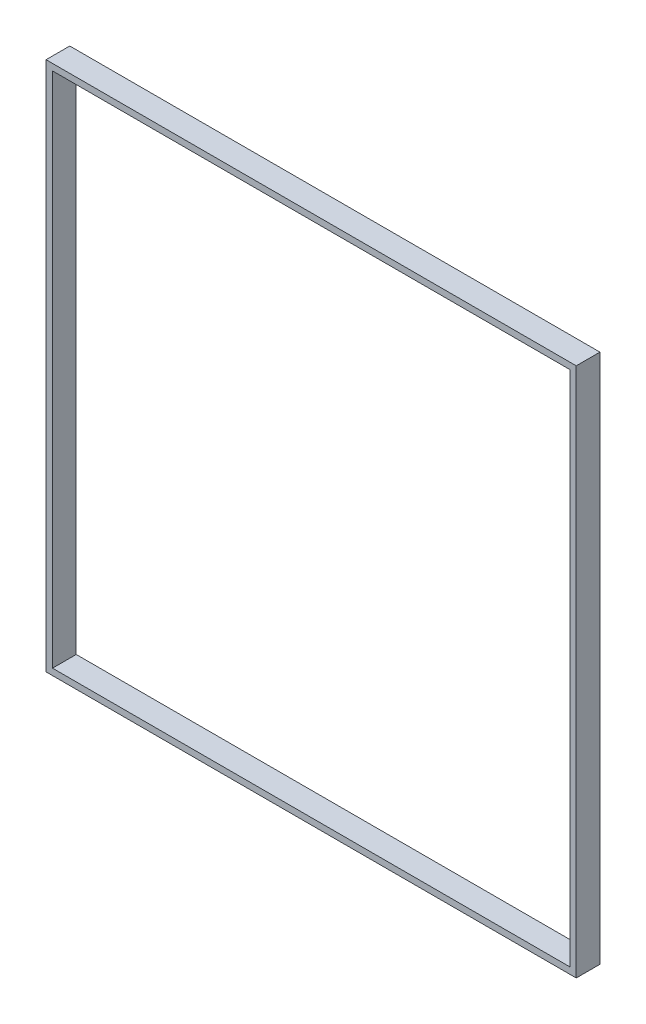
ISO-10303-21;
HEADER;
FILE_DESCRIPTION(('STEP AP214'),'2;1');
FILE_NAME('part.step','',(''),(''),'','','');
FILE_SCHEMA(('AUTOMOTIVE_DESIGN { 1 0 10303 214 1 1 1 1 }'));
ENDSEC;
DATA;
#1=APPLICATION_CONTEXT('core data for automotive mechanical design processes');
#2=APPLICATION_PROTOCOL_DEFINITION('international standard','automotive_design',2000,#1);
#3=PRODUCT_CONTEXT('',#1,'mechanical');
#4=PRODUCT('Part','Part','',(#3));
#5=PRODUCT_RELATED_PRODUCT_CATEGORY('part','',(#4));
#6=PRODUCT_DEFINITION_FORMATION('','',#4);
#7=PRODUCT_DEFINITION_CONTEXT('part definition',#1,'design');
#8=PRODUCT_DEFINITION('design','',#6,#7);
#9=PRODUCT_DEFINITION_SHAPE('','',#8);
#10=(LENGTH_UNIT() NAMED_UNIT(*) SI_UNIT(.MILLI.,.METRE.));
#11=(NAMED_UNIT(*) PLANE_ANGLE_UNIT() SI_UNIT($,.RADIAN.));
#12=(NAMED_UNIT(*) SI_UNIT($,.STERADIAN.) SOLID_ANGLE_UNIT());
#13=UNCERTAINTY_MEASURE_WITH_UNIT(LENGTH_MEASURE(1.E-05),#10,'distance_accuracy_value','');
#14=(GEOMETRIC_REPRESENTATION_CONTEXT(3) GLOBAL_UNCERTAINTY_ASSIGNED_CONTEXT((#13)) GLOBAL_UNIT_ASSIGNED_CONTEXT((#10,
#11,#12)) REPRESENTATION_CONTEXT('',''));
#15=CARTESIAN_POINT('',(0.,0.,0.));
#16=DIRECTION('',(0.,0.,1.));
#17=DIRECTION('',(1.,0.,0.));
#18=AXIS2_PLACEMENT_3D('',#15,#16,#17);
#19=CARTESIAN_POINT('',(-1562.1,-1562.1,139.7));
#20=DIRECTION('',(0.,0.,1.));
#21=DIRECTION('',(1.,0.,0.));
#22=AXIS2_PLACEMENT_3D('',#19,#20,#21);
#23=PLANE('',#22);
#24=DIRECTION('',(0.,-1.,0.));
#25=VECTOR('',#24,1.);
#26=CARTESIAN_POINT('',(-1562.1,1562.1,139.7));
#27=LINE('',#26,#25);
#28=CARTESIAN_POINT('',(-1562.1,1562.1,139.7));
#29=VERTEX_POINT('',#28);
#30=CARTESIAN_POINT('',(-1562.1,-1562.1,139.7));
#31=VERTEX_POINT('',#30);
#32=EDGE_CURVE('E139',#29,#31,#27,.T.);
#33=ORIENTED_EDGE('',*,*,#32,.T.);
#34=DIRECTION('',(1.,0.,0.));
#35=VECTOR('',#34,1.);
#36=CARTESIAN_POINT('',(-1562.1,-1562.1,139.7));
#37=LINE('',#36,#35);
#38=CARTESIAN_POINT('',(1562.1,-1562.1,139.7));
#39=VERTEX_POINT('',#38);
#40=EDGE_CURVE('E142',#31,#39,#37,.T.);
#41=ORIENTED_EDGE('',*,*,#40,.T.);
#42=DIRECTION('',(0.,1.,0.));
#43=VECTOR('',#42,1.);
#44=CARTESIAN_POINT('',(1562.1,1562.1,139.7));
#45=LINE('',#44,#43);
#46=CARTESIAN_POINT('',(1562.1,1562.1,139.7));
#47=VERTEX_POINT('',#46);
#48=EDGE_CURVE('E144',#39,#47,#45,.T.);
#49=ORIENTED_EDGE('',*,*,#48,.T.);
#50=DIRECTION('',(-1.,0.,0.));
#51=VECTOR('',#50,1.);
#52=CARTESIAN_POINT('',(-1562.1,1562.1,139.7));
#53=LINE('',#52,#51);
#54=EDGE_CURVE('E146',#47,#29,#53,.T.);
#55=ORIENTED_EDGE('',*,*,#54,.T.);
#56=EDGE_LOOP('',(#33,#41,#49,#55));
#57=FACE_BOUND('',#56,.T.);
#58=DIRECTION('',(1.,0.,0.));
#59=VECTOR('',#58,1.);
#60=CARTESIAN_POINT('',(-1524.,-1524.,139.7));
#61=LINE('',#60,#59);
#62=CARTESIAN_POINT('',(-1524.,-1524.,139.7));
#63=VERTEX_POINT('',#62);
#64=CARTESIAN_POINT('',(1524.,-1524.,139.7));
#65=VERTEX_POINT('',#64);
#66=EDGE_CURVE('E121',#63,#65,#61,.T.);
#67=ORIENTED_EDGE('',*,*,#66,.F.);
#68=DIRECTION('',(0.,-1.,0.));
#69=VECTOR('',#68,1.);
#70=CARTESIAN_POINT('',(-1524.,1524.,139.7));
#71=LINE('',#70,#69);
#72=CARTESIAN_POINT('',(-1524.,1524.,139.7));
#73=VERTEX_POINT('',#72);
#74=EDGE_CURVE('E110',#73,#63,#71,.T.);
#75=ORIENTED_EDGE('',*,*,#74,.F.);
#76=DIRECTION('',(-1.,0.,0.));
#77=VECTOR('',#76,1.);
#78=CARTESIAN_POINT('',(-1524.,1524.,139.7));
#79=LINE('',#78,#77);
#80=CARTESIAN_POINT('',(1524.,1524.,139.7));
#81=VERTEX_POINT('',#80);
#82=EDGE_CURVE('E125',#81,#73,#79,.T.);
#83=ORIENTED_EDGE('',*,*,#82,.F.);
#84=DIRECTION('',(0.,1.,0.));
#85=VECTOR('',#84,1.);
#86=CARTESIAN_POINT('',(1524.,1524.,139.7));
#87=LINE('',#86,#85);
#88=EDGE_CURVE('E123',#65,#81,#87,.T.);
#89=ORIENTED_EDGE('',*,*,#88,.F.);
#90=EDGE_LOOP('',(#67,#75,#83,#89));
#91=FACE_BOUND('',#90,.T.);
#92=ADVANCED_FACE('F30',(#57,#91),#23,.T.);
#93=CARTESIAN_POINT('',(-1562.1,-1562.1,0.));
#94=DIRECTION('',(0.,0.,1.));
#95=DIRECTION('',(1.,0.,0.));
#96=AXIS2_PLACEMENT_3D('',#93,#94,#95);
#97=PLANE('',#96);
#98=DIRECTION('',(0.,-1.,0.));
#99=VECTOR('',#98,1.);
#100=CARTESIAN_POINT('',(-1562.1,1562.1,0.));
#101=LINE('',#100,#99);
#102=CARTESIAN_POINT('',(-1562.1,1562.1,0.));
#103=VERTEX_POINT('',#102);
#104=CARTESIAN_POINT('',(-1562.1,-1562.1,0.));
#105=VERTEX_POINT('',#104);
#106=EDGE_CURVE('E111',#103,#105,#101,.T.);
#107=ORIENTED_EDGE('',*,*,#106,.F.);
#108=DIRECTION('',(-1.,0.,0.));
#109=VECTOR('',#108,1.);
#110=CARTESIAN_POINT('',(-1562.1,1562.1,0.));
#111=LINE('',#110,#109);
#112=CARTESIAN_POINT('',(1562.1,1562.1,0.));
#113=VERTEX_POINT('',#112);
#114=EDGE_CURVE('E137',#113,#103,#111,.T.);
#115=ORIENTED_EDGE('',*,*,#114,.F.);
#116=DIRECTION('',(0.,1.,0.));
#117=VECTOR('',#116,1.);
#118=CARTESIAN_POINT('',(1562.1,1562.1,0.));
#119=LINE('',#118,#117);
#120=CARTESIAN_POINT('',(1562.1,-1562.1,0.));
#121=VERTEX_POINT('',#120);
#122=EDGE_CURVE('E135',#121,#113,#119,.T.);
#123=ORIENTED_EDGE('',*,*,#122,.F.);
#124=DIRECTION('',(1.,0.,0.));
#125=VECTOR('',#124,1.);
#126=CARTESIAN_POINT('',(-1562.1,-1562.1,0.));
#127=LINE('',#126,#125);
#128=EDGE_CURVE('E133',#105,#121,#127,.T.);
#129=ORIENTED_EDGE('',*,*,#128,.F.);
#130=EDGE_LOOP('',(#107,#115,#123,#129));
#131=FACE_BOUND('',#130,.T.);
#132=DIRECTION('',(0.,-1.,0.));
#133=VECTOR('',#132,1.);
#134=CARTESIAN_POINT('',(-1524.,1524.,0.));
#135=LINE('',#134,#133);
#136=CARTESIAN_POINT('',(-1524.,1524.,0.));
#137=VERTEX_POINT('',#136);
#138=CARTESIAN_POINT('',(-1524.,-1524.,0.));
#139=VERTEX_POINT('',#138);
#140=EDGE_CURVE('E53',#137,#139,#135,.T.);
#141=ORIENTED_EDGE('',*,*,#140,.T.);
#142=DIRECTION('',(1.,0.,0.));
#143=VECTOR('',#142,1.);
#144=CARTESIAN_POINT('',(-1524.,-1524.,0.));
#145=LINE('',#144,#143);
#146=CARTESIAN_POINT('',(1524.,-1524.,0.));
#147=VERTEX_POINT('',#146);
#148=EDGE_CURVE('E97',#139,#147,#145,.T.);
#149=ORIENTED_EDGE('',*,*,#148,.T.);
#150=DIRECTION('',(0.,1.,0.));
#151=VECTOR('',#150,1.);
#152=CARTESIAN_POINT('',(1524.,1524.,0.));
#153=LINE('',#152,#151);
#154=CARTESIAN_POINT('',(1524.,1524.,0.));
#155=VERTEX_POINT('',#154);
#156=EDGE_CURVE('E106',#147,#155,#153,.T.);
#157=ORIENTED_EDGE('',*,*,#156,.T.);
#158=DIRECTION('',(-1.,0.,0.));
#159=VECTOR('',#158,1.);
#160=CARTESIAN_POINT('',(-1524.,1524.,0.));
#161=LINE('',#160,#159);
#162=EDGE_CURVE('E115',#155,#137,#161,.T.);
#163=ORIENTED_EDGE('',*,*,#162,.T.);
#164=EDGE_LOOP('',(#141,#149,#157,#163));
#165=FACE_BOUND('',#164,.T.);
#166=ADVANCED_FACE('F114',(#131,#165),#97,.F.);
#167=CARTESIAN_POINT('',(-1562.1,1562.1,139.7));
#168=DIRECTION('',(1.,0.,0.));
#169=DIRECTION('',(0.,1.,0.));
#170=AXIS2_PLACEMENT_3D('',#167,#168,#169);
#171=PLANE('',#170);
#172=ORIENTED_EDGE('',*,*,#106,.T.);
#173=DIRECTION('',(0.,0.,-1.));
#174=VECTOR('',#173,1.);
#175=CARTESIAN_POINT('',(-1562.1,-1562.1,139.7));
#176=LINE('',#175,#174);
#177=EDGE_CURVE('E11',#31,#105,#176,.T.);
#178=ORIENTED_EDGE('',*,*,#177,.F.);
#179=ORIENTED_EDGE('',*,*,#32,.F.);
#180=DIRECTION('',(0.,0.,-1.));
#181=VECTOR('',#180,1.);
#182=CARTESIAN_POINT('',(-1562.1,1562.1,139.7));
#183=LINE('',#182,#181);
#184=EDGE_CURVE('E148',#29,#103,#183,.T.);
#185=ORIENTED_EDGE('',*,*,#184,.T.);
#186=EDGE_LOOP('',(#172,#178,#179,#185));
#187=FACE_BOUND('',#186,.T.);
#188=ADVANCED_FACE('F32',(#187),#171,.F.);
#189=CARTESIAN_POINT('',(-1562.1,-1562.1,139.7));
#190=DIRECTION('',(0.,1.,0.));
#191=DIRECTION('',(0.,0.,1.));
#192=AXIS2_PLACEMENT_3D('',#189,#190,#191);
#193=PLANE('',#192);
#194=ORIENTED_EDGE('',*,*,#128,.T.);
#195=DIRECTION('',(0.,0.,-1.));
#196=VECTOR('',#195,1.);
#197=CARTESIAN_POINT('',(1562.1,-1562.1,139.7));
#198=LINE('',#197,#196);
#199=EDGE_CURVE('E38',#39,#121,#198,.T.);
#200=ORIENTED_EDGE('',*,*,#199,.F.);
#201=ORIENTED_EDGE('',*,*,#40,.F.);
#202=ORIENTED_EDGE('',*,*,#177,.T.);
#203=EDGE_LOOP('',(#194,#200,#201,#202));
#204=FACE_BOUND('',#203,.T.);
#205=ADVANCED_FACE('F173',(#204),#193,.F.);
#206=CARTESIAN_POINT('',(1562.1,1562.1,139.7));
#207=DIRECTION('',(-1.,0.,0.));
#208=DIRECTION('',(0.,-1.,0.));
#209=AXIS2_PLACEMENT_3D('',#206,#207,#208);
#210=PLANE('',#209);
#211=ORIENTED_EDGE('',*,*,#122,.T.);
#212=DIRECTION('',(0.,0.,-1.));
#213=VECTOR('',#212,1.);
#214=CARTESIAN_POINT('',(1562.1,1562.1,139.7));
#215=LINE('',#214,#213);
#216=EDGE_CURVE('E151',#47,#113,#215,.T.);
#217=ORIENTED_EDGE('',*,*,#216,.F.);
#218=ORIENTED_EDGE('',*,*,#48,.F.);
#219=ORIENTED_EDGE('',*,*,#199,.T.);
#220=EDGE_LOOP('',(#211,#217,#218,#219));
#221=FACE_BOUND('',#220,.T.);
#222=ADVANCED_FACE('F158',(#221),#210,.F.);
#223=CARTESIAN_POINT('',(-1562.1,1562.1,139.7));
#224=DIRECTION('',(0.,-1.,0.));
#225=DIRECTION('',(0.,0.,-1.));
#226=AXIS2_PLACEMENT_3D('',#223,#224,#225);
#227=PLANE('',#226);
#228=ORIENTED_EDGE('',*,*,#114,.T.);
#229=ORIENTED_EDGE('',*,*,#184,.F.);
#230=ORIENTED_EDGE('',*,*,#54,.F.);
#231=ORIENTED_EDGE('',*,*,#216,.T.);
#232=EDGE_LOOP('',(#228,#229,#230,#231));
#233=FACE_BOUND('',#232,.T.);
#234=ADVANCED_FACE('F166',(#233),#227,.F.);
#235=CARTESIAN_POINT('',(-1524.,1524.,139.7));
#236=DIRECTION('',(1.,0.,0.));
#237=DIRECTION('',(0.,1.,0.));
#238=AXIS2_PLACEMENT_3D('',#235,#236,#237);
#239=PLANE('',#238);
#240=ORIENTED_EDGE('',*,*,#140,.F.);
#241=DIRECTION('',(0.,0.,-1.));
#242=VECTOR('',#241,1.);
#243=CARTESIAN_POINT('',(-1524.,1524.,139.7));
#244=LINE('',#243,#242);
#245=EDGE_CURVE('E127',#73,#137,#244,.T.);
#246=ORIENTED_EDGE('',*,*,#245,.F.);
#247=ORIENTED_EDGE('',*,*,#74,.T.);
#248=DIRECTION('',(0.,0.,-1.));
#249=VECTOR('',#248,1.);
#250=CARTESIAN_POINT('',(-1524.,-1524.,139.7));
#251=LINE('',#250,#249);
#252=EDGE_CURVE('E99',#63,#139,#251,.T.);
#253=ORIENTED_EDGE('',*,*,#252,.T.);
#254=EDGE_LOOP('',(#240,#246,#247,#253));
#255=FACE_BOUND('',#254,.T.);
#256=ADVANCED_FACE('F108',(#255),#239,.T.);
#257=CARTESIAN_POINT('',(-1524.,-1524.,139.7));
#258=DIRECTION('',(0.,1.,0.));
#259=DIRECTION('',(0.,0.,1.));
#260=AXIS2_PLACEMENT_3D('',#257,#258,#259);
#261=PLANE('',#260);
#262=ORIENTED_EDGE('',*,*,#148,.F.);
#263=ORIENTED_EDGE('',*,*,#252,.F.);
#264=ORIENTED_EDGE('',*,*,#66,.T.);
#265=DIRECTION('',(0.,0.,-1.));
#266=VECTOR('',#265,1.);
#267=CARTESIAN_POINT('',(1524.,-1524.,139.7));
#268=LINE('',#267,#266);
#269=EDGE_CURVE('E102',#65,#147,#268,.T.);
#270=ORIENTED_EDGE('',*,*,#269,.T.);
#271=EDGE_LOOP('',(#262,#263,#264,#270));
#272=FACE_BOUND('',#271,.T.);
#273=ADVANCED_FACE('F98',(#272),#261,.T.);
#274=CARTESIAN_POINT('',(1524.,1524.,139.7));
#275=DIRECTION('',(-1.,0.,0.));
#276=DIRECTION('',(0.,-1.,0.));
#277=AXIS2_PLACEMENT_3D('',#274,#275,#276);
#278=PLANE('',#277);
#279=ORIENTED_EDGE('',*,*,#156,.F.);
#280=ORIENTED_EDGE('',*,*,#269,.F.);
#281=ORIENTED_EDGE('',*,*,#88,.T.);
#282=DIRECTION('',(0.,0.,-1.));
#283=VECTOR('',#282,1.);
#284=CARTESIAN_POINT('',(1524.,1524.,139.7));
#285=LINE('',#284,#283);
#286=EDGE_CURVE('E45',#81,#155,#285,.T.);
#287=ORIENTED_EDGE('',*,*,#286,.T.);
#288=EDGE_LOOP('',(#279,#280,#281,#287));
#289=FACE_BOUND('',#288,.T.);
#290=ADVANCED_FACE('F195',(#289),#278,.T.);
#291=CARTESIAN_POINT('',(-1524.,1524.,139.7));
#292=DIRECTION('',(0.,-1.,0.));
#293=DIRECTION('',(0.,0.,-1.));
#294=AXIS2_PLACEMENT_3D('',#291,#292,#293);
#295=PLANE('',#294);
#296=ORIENTED_EDGE('',*,*,#162,.F.);
#297=ORIENTED_EDGE('',*,*,#286,.F.);
#298=ORIENTED_EDGE('',*,*,#82,.T.);
#299=ORIENTED_EDGE('',*,*,#245,.T.);
#300=EDGE_LOOP('',(#296,#297,#298,#299));
#301=FACE_BOUND('',#300,.T.);
#302=ADVANCED_FACE('F200',(#301),#295,.T.);
#303=CLOSED_SHELL('',(#92,#166,#188,#205,#222,#234,#256,#273,#290,#302));
#304=MANIFOLD_SOLID_BREP('B2',#303);
#305=ADVANCED_BREP_SHAPE_REPRESENTATION('',(#18,#304),#14);
#306=SHAPE_DEFINITION_REPRESENTATION(#9,#305);
ENDSEC;
END-ISO-10303-21;
